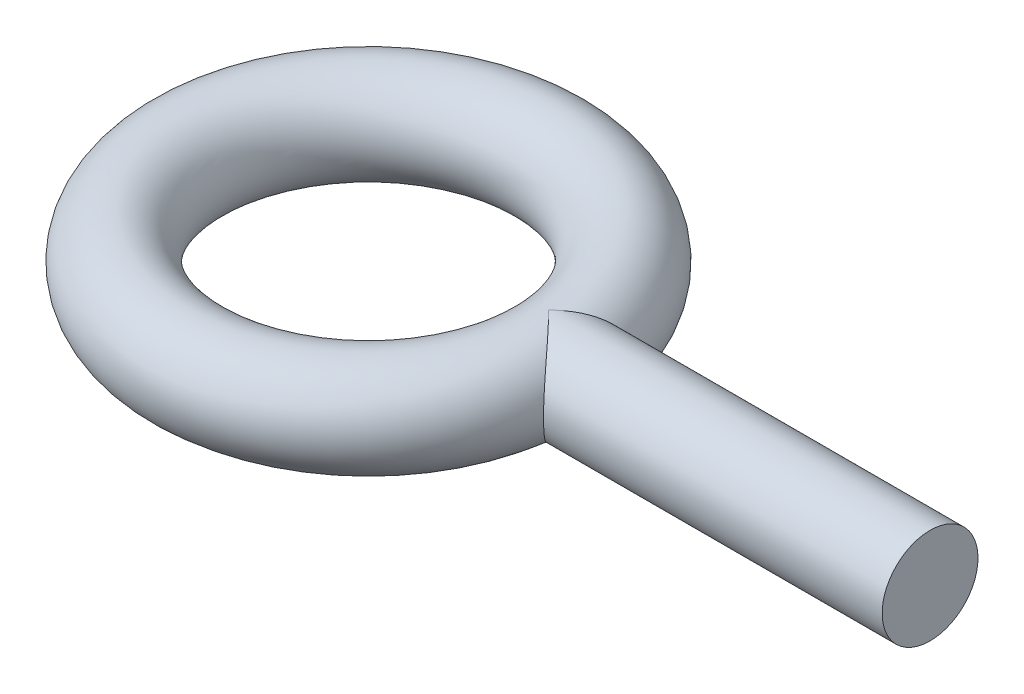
from build123d import *

# Parameters (mm, degrees)
SKETCH2_R                 = 3.175
EXTRUDE1_REACH            = 56.555
EXTRUDE1_END_MAJOR_RADIUS = 11.938
EXTRUDE1_END_MINOR_RADIUS = 3.175
SKETCH3_R                 = 3.175


with BuildPart() as part:
    # Sketch2 → Revolve1 (revolve)
    with BuildSketch(Plane.XY, mode=Mode.PRIVATE) as revolve1_sk:
        with Locations((-11.938, 0)):
            Circle(SKETCH2_R)
    revolve(revolve1_sk.sketch.rotate(Axis((0, 0, 0), (0, 1, 0)), 270), axis=Axis((0, 0, 0), (0, 1, 0)))

    # Extrude1: up to this torus (the profile starts outside it)
    extrude1_end = Plane(origin=(0, 0, 0), z_dir=(0, -1, 0)) * Torus(EXTRUDE1_END_MAJOR_RADIUS, EXTRUDE1_END_MINOR_RADIUS, mode=Mode.PRIVATE)
    # Sketch3 → Extrude1 (add, up to the surface)
    with BuildSketch(Plane(origin=(37.211, 0, 0), x_dir=(0, 0, -1), z_dir=(1, 0, 0)), mode=Mode.PRIVATE) as extrude1_sk1:
        Circle(SKETCH3_R)
    extrude1_tool1 = extrude(extrude1_sk1.sketch, amount=-EXTRUDE1_REACH, mode=Mode.PRIVATE) - extrude1_end
    add(extrude1_tool1.solids().sort_by_distance((37.211, 0, 0))[0])


solid = part.part
